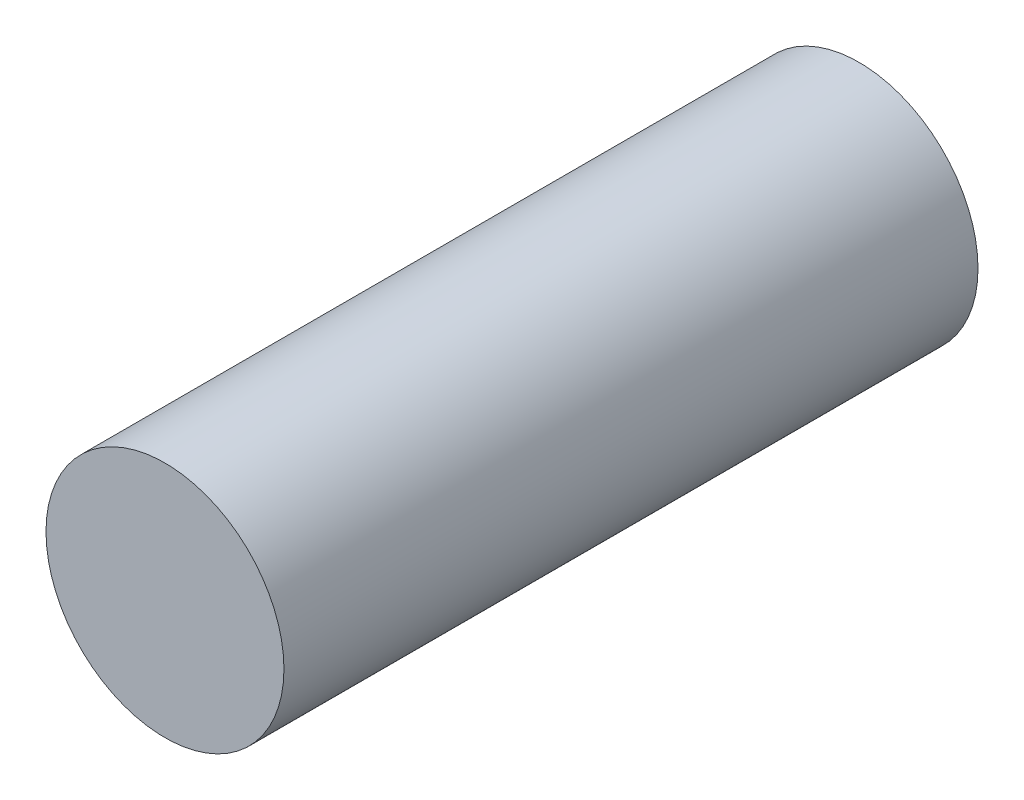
from build123d import *

# Parameters (mm, degrees)
SKETCH_1_R      = 1.8
EXTRUDE_1_DEPTH = 10.5


with BuildPart() as part:
    # Sketch 1 → Extrude 1 (new body)
    with BuildSketch(Plane.XY):
        with Locations(Location((0, 0, 0), (0, 0, 180))):
            Circle(SKETCH_1_R)
    extrude(amount=EXTRUDE_1_DEPTH)


solid = part.part
